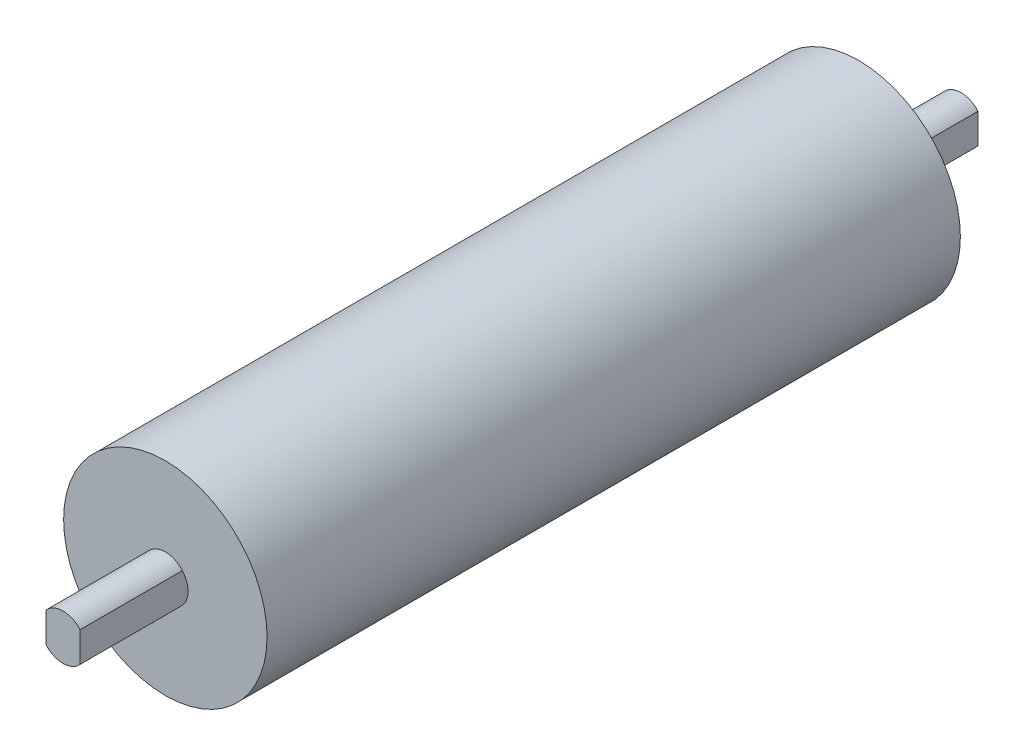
from build123d import *

# Parameters (mm, degrees)
SKETCH_1_R          = 44.75
EXTRUDE_1_DEPTH     = 152.5
SKETCH_2_R          = 10
EXTRUDE_2_DEPTH     = 45
CUT_EXTRUDE_START   = -350
CUT_EXTRUDE_1_DEPTH = 350


with BuildPart() as part:
    # Sketch 1 → Extrude 1 (new, symmetric)
    with BuildSketch(Plane.XY):
        Circle(SKETCH_1_R)
    extrude(amount=EXTRUDE_1_DEPTH, both=True)

    # Sketch 2 → Extrude 2 (add)
    with BuildSketch(Plane.XY.offset(152.5)):
        with Locations(Location((0, 0, 0), (0, 0, 180))):
            Circle(SKETCH_2_R)
    extrude_2 = extrude(amount=EXTRUDE_2_DEPTH)

    # Sketch 3 → Cut-Extrude 1 (cut)
    with BuildSketch(Plane.XY.offset(197.5).offset(CUT_EXTRUDE_START)):
        with BuildLine():
            Line((-7.5, 6.614378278), (-7.5, -6.614378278))
            ThreePointArc((-7.5, -6.614378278), (-10, 0), (-7.5, 6.614378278))
        make_face()
        with BuildLine():
            Line((7.5, 6.614378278), (7.5, -6.614378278))
            ThreePointArc((7.5, -6.614378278), (10, 0), (7.5, 6.614378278))
        make_face()
    cut_extrude_1 = extrude(amount=CUT_EXTRUDE_1_DEPTH, mode=Mode.SUBTRACT)

    # Mirror 1: Extrude 2, Cut-Extrude 1 across plane
    add(extrude_2.mirror(Plane.XY))
    add(cut_extrude_1.mirror(Plane.XY), mode=Mode.SUBTRACT)


solid = part.part
